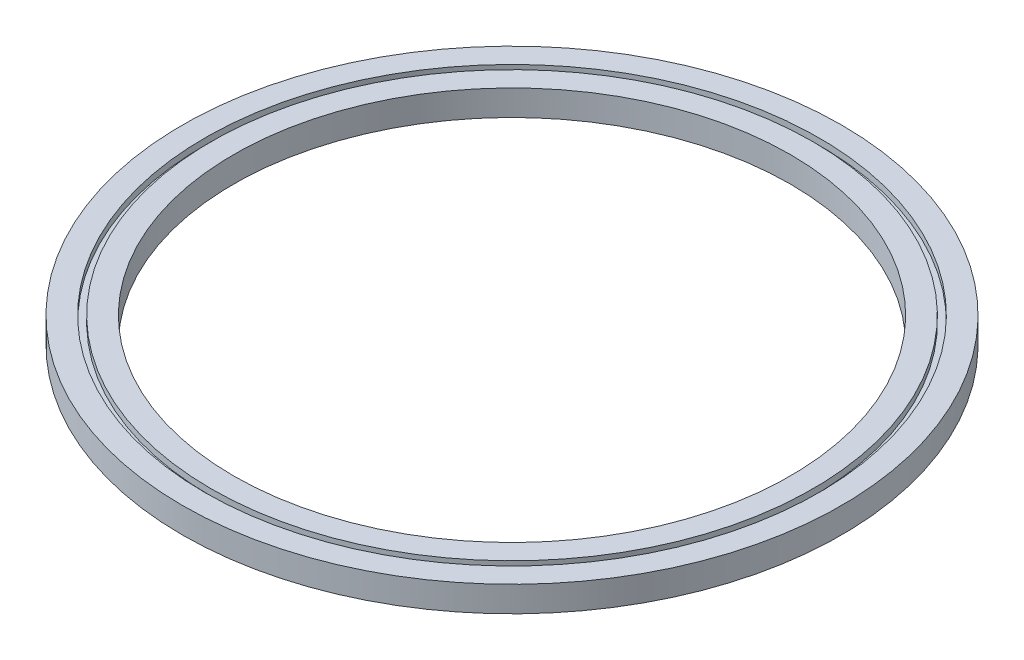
from build123d import *


with BuildPart() as part:
    # Esquisse1 → R_volution1 (revolve)
    with BuildSketch(Plane.XY, mode=Mode.PRIVATE) as r_volution1_sk:
        Polygon((21.75, 0), (21.75, -2), (25.75, -2), (25.75, 0), (24, 0), (24, -0.5), (23.5, -0.5), (23.5, 0), align=None)
    revolve(r_volution1_sk.sketch.rotate(Axis((0, 0, 0), (0, -1, 0)), 90), axis=Axis((0, 0, 0), (0, -1, 0)))


solid = part.part
